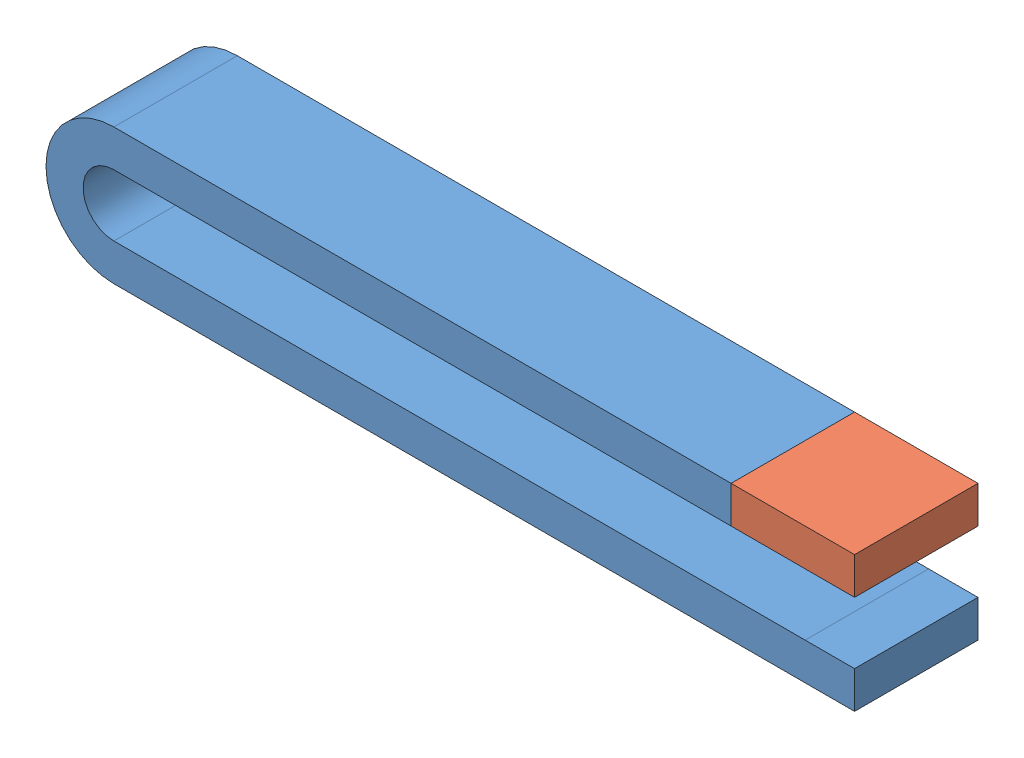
SolidWorks assembly clip.SLDASM, configuration Default (file format 3100). Lengths in mm.
Overall size (32.75 5.5 5).
2 component instances, 2 part files, 3 mates.
Components (placement in the parent):
- clip 01-1: clip 01.SLDPRT [Default] at origin size (32.75 5.5 5)
- clip 02-1: clip 02.SLDPRT [Default] at (25 0.5 0) x (0 0 -1) z (1 0 0) size (5 1.5 5)
Mates (geometry in assembly coordinates):
- Coincident3: coincident aligned: plane of clip 01-1 through (0 4.75 2.5) normal (0 1 0); plane of clip 02-1 through (30 4.75 -2.5) normal (0 1 0)
- Coincident4: coincident anti-aligned: plane of clip 01-1 through (25 4.75 2.5) normal (1 0 0); plane of clip 02-1 through (25 4.75 2.5) normal (-1 0 0)
- Coincident5: coincident aligned: plane of clip 01-1 through (0 0.75 2.5) normal (0 0 1); plane of clip 02-1 through (30 4.75 2.5) normal (0 0 1)
